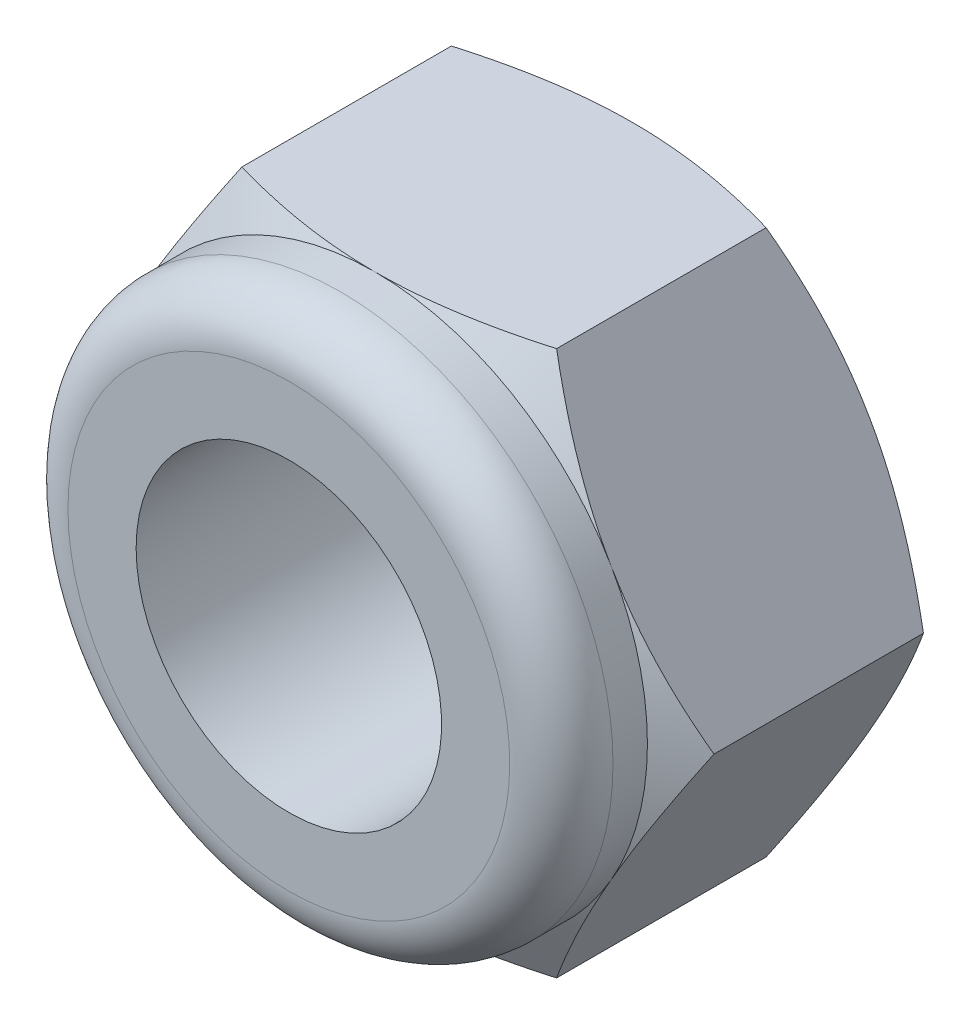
ISO-10303-21;
HEADER;
FILE_DESCRIPTION(('STEP AP214'),'2;1');
FILE_NAME('part.step','',(''),(''),'','','');
FILE_SCHEMA(('AUTOMOTIVE_DESIGN { 1 0 10303 214 1 1 1 1 }'));
ENDSEC;
DATA;
#1=APPLICATION_CONTEXT('core data for automotive mechanical design processes');
#2=APPLICATION_PROTOCOL_DEFINITION('international standard','automotive_design',2000,#1);
#3=PRODUCT_CONTEXT('',#1,'mechanical');
#4=PRODUCT('Part','Part','',(#3));
#5=PRODUCT_RELATED_PRODUCT_CATEGORY('part','',(#4));
#6=PRODUCT_DEFINITION_FORMATION('','',#4);
#7=PRODUCT_DEFINITION_CONTEXT('part definition',#1,'design');
#8=PRODUCT_DEFINITION('design','',#6,#7);
#9=PRODUCT_DEFINITION_SHAPE('','',#8);
#10=(LENGTH_UNIT() NAMED_UNIT(*) SI_UNIT(.MILLI.,.METRE.));
#11=(NAMED_UNIT(*) PLANE_ANGLE_UNIT() SI_UNIT($,.RADIAN.));
#12=(NAMED_UNIT(*) SI_UNIT($,.STERADIAN.) SOLID_ANGLE_UNIT());
#13=UNCERTAINTY_MEASURE_WITH_UNIT(LENGTH_MEASURE(1.E-05),#10,'distance_accuracy_value','');
#14=(GEOMETRIC_REPRESENTATION_CONTEXT(3) GLOBAL_UNCERTAINTY_ASSIGNED_CONTEXT((#13)) GLOBAL_UNIT_ASSIGNED_CONTEXT((#10,
#11,#12)) REPRESENTATION_CONTEXT('',''));
#15=CARTESIAN_POINT('',(0.,0.,0.));
#16=DIRECTION('',(0.,0.,1.));
#17=DIRECTION('',(1.,0.,0.));
#18=AXIS2_PLACEMENT_3D('',#15,#16,#17);
#19=CARTESIAN_POINT('',(0.,0.,-0.853596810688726));
#20=DIRECTION('',(0.,0.,-1.));
#21=DIRECTION('',(-1.,0.,0.));
#22=AXIS2_PLACEMENT_3D('',#19,#20,#21);
#23=CONICAL_SURFACE('',#22,10.9784730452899,1.0471975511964);
#24=CARTESIAN_POINT('',(0.,9.5,-5.96355830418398E-13));
#25=CARTESIAN_POINT('',(0.232800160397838,9.5,3.88261454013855E-05));
#26=CARTESIAN_POINT('',(0.465589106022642,9.5,-0.0049396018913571));
#27=CARTESIAN_POINT('',(0.930709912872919,9.5,-0.0246423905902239));
#28=CARTESIAN_POINT('',(1.16304185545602,9.5,-0.0393648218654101));
#29=CARTESIAN_POINT('',(1.62574797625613,9.5,-0.0781700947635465));
#30=CARTESIAN_POINT('',(1.85612613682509,9.5,-0.102205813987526));
#31=CARTESIAN_POINT('',(2.31578485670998,9.5,-0.159120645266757));
#32=CARTESIAN_POINT('',(2.54506538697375,9.5,-0.191999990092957));
#33=CARTESIAN_POINT('',(3.23031014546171,9.5,-0.302887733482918));
#34=CARTESIAN_POINT('',(3.6842837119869,9.5,-0.393199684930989));
#35=CARTESIAN_POINT('',(4.58832687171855,9.5,-0.601482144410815));
#36=CARTESIAN_POINT('',(5.03836493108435,9.5,-0.719590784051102));
#37=CARTESIAN_POINT('',(5.48482755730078,9.5,-0.848505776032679));
#38=B_SPLINE_CURVE_WITH_KNOTS('',3,(#24,#25,#26,#27,#28,#29,#30,#31,#32,#33,#34,#35,#36,#37),
.UNSPECIFIED.,.F.,.F.,(4,2,2,2,2,2,4),(0.,0.698329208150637,1.39652018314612,2.09122370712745,
2.78594551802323,4.17356828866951,5.56823793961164),.UNSPECIFIED.);
#39=CARTESIAN_POINT('',(0.,9.5,4.54931231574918E-13));
#40=VERTEX_POINT('',#39);
#41=CARTESIAN_POINT('',(5.48482755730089,9.5,-0.848505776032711));
#42=VERTEX_POINT('',#41);
#43=EDGE_CURVE('E340',#40,#42,#38,.T.);
#44=ORIENTED_EDGE('',*,*,#43,.F.);
#45=CARTESIAN_POINT('',(0.,0.,0.));
#46=DIRECTION('',(0.,0.,1.));
#47=DIRECTION('',(1.,0.,0.));
#48=AXIS2_PLACEMENT_3D('',#45,#46,#47);
#49=CIRCLE('',#48,9.5);
#50=CARTESIAN_POINT('',(8.22724133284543,4.75000000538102,0.));
#51=VERTEX_POINT('',#50);
#52=EDGE_CURVE('E518',#51,#40,#49,.T.);
#53=ORIENTED_EDGE('',*,*,#52,.F.);
#54=CARTESIAN_POINT('',(5.48482755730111,9.4999999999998,-0.848505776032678));
#55=CARTESIAN_POINT('',(5.70805886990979,9.11335202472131,-0.719590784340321));
#56=CARTESIAN_POINT('',(5.93307789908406,8.72360763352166,-0.601482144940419));
#57=CARTESIAN_POINT('',(6.3850994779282,7.94068329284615,-0.393199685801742));
#58=CARTESIAN_POINT('',(6.61208626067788,7.54753065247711,-0.302887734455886));
#59=CARTESIAN_POINT('',(6.95470863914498,6.95409128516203,-0.191999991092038));
#60=CARTESIAN_POINT('',(7.06934890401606,6.75552852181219,-0.159120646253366));
#61=CARTESIAN_POINT('',(7.29917826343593,6.35745239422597,-0.102205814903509));
#62=CARTESIAN_POINT('',(7.41436734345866,6.1579390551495,-0.0781700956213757));
#63=CARTESIAN_POINT('',(7.64572040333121,5.75722380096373,-0.0393648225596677));
#64=CARTESIAN_POINT('',(7.761886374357,5.55601843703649,-0.024642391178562));
#65=CARTESIAN_POINT('',(7.9944467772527,5.15321200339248,-0.00493960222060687));
#66=CARTESIAN_POINT('',(8.11084124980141,4.95161086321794,3.88259693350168E-05));
#67=CARTESIAN_POINT('',(8.22724132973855,4.75000001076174,-4.35667272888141E-13));
#68=B_SPLINE_CURVE_WITH_KNOTS('',3,(#54,#55,#56,#57,#58,#59,#60,#61,#62,#63,#64,#65,#66,#67),
.UNSPECIFIED.,.F.,.F.,(4,2,2,2,2,2,4),(0.,1.39466964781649,2.78229241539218,3.47701422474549,
4.1717177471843,4.86990872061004,5.56823792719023),.UNSPECIFIED.);
#69=EDGE_CURVE('E125',#42,#51,#68,.T.);
#70=ORIENTED_EDGE('',*,*,#69,.F.);
#71=EDGE_LOOP('',(#44,#53,#70));
#72=FACE_BOUND('',#71,.T.);
#73=ADVANCED_FACE('F41',(#72),#23,.T.);
#74=CARTESIAN_POINT('',(0.,0.,-0.853596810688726));
#75=DIRECTION('',(0.,0.,-1.));
#76=DIRECTION('',(-1.,0.,0.));
#77=AXIS2_PLACEMENT_3D('',#74,#75,#76);
#78=CONICAL_SURFACE('',#77,10.9784730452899,1.0471975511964);
#79=CARTESIAN_POINT('',(-8.22724132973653,4.75000001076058,9.09388655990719E-13));
#80=CARTESIAN_POINT('',(-8.11084124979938,4.95161086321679,3.88259706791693E-05));
#81=CARTESIAN_POINT('',(-7.99444677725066,5.15321200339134,-0.0049396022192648));
#82=CARTESIAN_POINT('',(-7.76188637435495,5.55601843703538,-0.0246423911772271));
#83=CARTESIAN_POINT('',(-7.64572040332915,5.75722380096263,-0.0393648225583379));
#84=CARTESIAN_POINT('',(-7.41436734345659,6.15793905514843,-0.0781700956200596));
#85=CARTESIAN_POINT('',(-7.29917826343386,6.35745239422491,-0.102205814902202));
#86=CARTESIAN_POINT('',(-7.06934890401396,6.75552852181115,-0.159120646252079));
#87=CARTESIAN_POINT('',(-6.95470863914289,6.954091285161,-0.191999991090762));
#88=CARTESIAN_POINT('',(-6.61208626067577,7.54753065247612,-0.302887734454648));
#89=CARTESIAN_POINT('',(-6.38509947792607,7.94068329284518,-0.393199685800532));
#90=CARTESIAN_POINT('',(-5.93307789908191,8.72360763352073,-0.601482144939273));
#91=CARTESIAN_POINT('',(-5.70805886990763,9.11335202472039,-0.719590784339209));
#92=CARTESIAN_POINT('',(-5.48482755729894,9.49999999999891,-0.848505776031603));
#93=B_SPLINE_CURVE_WITH_KNOTS('',3,(#79,#80,#81,#82,#83,#84,#85,#86,#87,#88,#89,#90,#91,#92),
.UNSPECIFIED.,.F.,.F.,(4,2,2,2,2,2,4),(0.,0.69832920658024,1.39652018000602,2.09122370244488,
2.78594551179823,4.17356827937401,5.56823792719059),.UNSPECIFIED.);
#94=CARTESIAN_POINT('',(-8.22724133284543,4.75000000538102,4.54931231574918E-13));
#95=VERTEX_POINT('',#94);
#96=CARTESIAN_POINT('',(-5.48482755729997,9.49999999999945,-0.848505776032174));
#97=VERTEX_POINT('',#96);
#98=EDGE_CURVE('E173',#95,#97,#93,.T.);
#99=ORIENTED_EDGE('',*,*,#98,.F.);
#100=CARTESIAN_POINT('',(0.,0.,0.));
#101=DIRECTION('',(0.,0.,1.));
#102=DIRECTION('',(1.,0.,0.));
#103=AXIS2_PLACEMENT_3D('',#100,#101,#102);
#104=CIRCLE('',#103,9.5);
#105=EDGE_CURVE('E467',#40,#95,#104,.T.);
#106=ORIENTED_EDGE('',*,*,#105,.F.);
#107=CARTESIAN_POINT('',(-5.48482755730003,9.5,-0.848505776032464));
#108=CARTESIAN_POINT('',(-5.03836493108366,9.5,-0.719590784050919));
#109=CARTESIAN_POINT('',(-4.58832687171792,9.5,-0.601482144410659));
#110=CARTESIAN_POINT('',(-3.68428371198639,9.5,-0.393199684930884));
#111=CARTESIAN_POINT('',(-3.23031014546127,9.5,-0.302887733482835));
#112=CARTESIAN_POINT('',(-2.5450653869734,9.5,-0.191999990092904));
#113=CARTESIAN_POINT('',(-2.31578485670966,9.5,-0.159120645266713));
#114=CARTESIAN_POINT('',(-1.85612613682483,9.5,-0.102205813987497));
#115=CARTESIAN_POINT('',(-1.6257479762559,9.5,-0.0781700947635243));
#116=CARTESIAN_POINT('',(-1.16304185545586,9.5,-0.0393648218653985));
#117=CARTESIAN_POINT('',(-0.930709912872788,9.5,-0.0246423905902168));
#118=CARTESIAN_POINT('',(-0.465589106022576,9.5,-0.00493960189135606));
#119=CARTESIAN_POINT('',(-0.232800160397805,9.5,3.88261454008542E-05));
#120=CARTESIAN_POINT('',(0.,9.5,-5.9638344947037E-13));
#121=B_SPLINE_CURVE_WITH_KNOTS('',3,(#107,#108,#109,#110,#111,#112,#113,#114,#115,#116,#117,
#118,#119,#120),.UNSPECIFIED.,.F.,.F.,(4,2,2,2,2,2,4),(0.,1.39466965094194,2.78229242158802,
3.4770142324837,4.17171775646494,4.86990873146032,5.56823793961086),.UNSPECIFIED.);
#122=EDGE_CURVE('E346',#97,#40,#121,.T.);
#123=ORIENTED_EDGE('',*,*,#122,.F.);
#124=EDGE_LOOP('',(#99,#106,#123));
#125=FACE_BOUND('',#124,.T.);
#126=ADVANCED_FACE('F287',(#125),#78,.T.);
#127=CARTESIAN_POINT('',(0.,0.,-0.853596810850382));
#128=DIRECTION('',(0.,0.,-1.));
#129=DIRECTION('',(0.,1.,0.));
#130=AXIS2_PLACEMENT_3D('',#127,#128,#129);
#131=CONICAL_SURFACE('',#130,10.9784730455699,1.0471975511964);
#132=CARTESIAN_POINT('',(0.,-9.5,-5.96285983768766E-13));
#133=CARTESIAN_POINT('',(-0.232800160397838,-9.5,3.88261454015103E-05));
#134=CARTESIAN_POINT('',(-0.465589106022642,-9.5,-0.00493960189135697));
#135=CARTESIAN_POINT('',(-0.930709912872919,-9.5,-0.0246423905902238));
#136=CARTESIAN_POINT('',(-1.16304185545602,-9.5,-0.0393648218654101));
#137=CARTESIAN_POINT('',(-1.62574797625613,-9.5,-0.0781700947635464));
#138=CARTESIAN_POINT('',(-1.85612613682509,-9.5,-0.102205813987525));
#139=CARTESIAN_POINT('',(-2.31578485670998,-9.5,-0.159120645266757));
#140=CARTESIAN_POINT('',(-2.54506538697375,-9.5,-0.191999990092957));
#141=CARTESIAN_POINT('',(-3.23031014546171,-9.5,-0.302887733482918));
#142=CARTESIAN_POINT('',(-3.6842837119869,-9.5,-0.393199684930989));
#143=CARTESIAN_POINT('',(-4.58832687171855,-9.5,-0.601482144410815));
#144=CARTESIAN_POINT('',(-5.03836493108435,-9.5,-0.719590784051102));
#145=CARTESIAN_POINT('',(-5.48482755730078,-9.5,-0.848505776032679));
#146=B_SPLINE_CURVE_WITH_KNOTS('',3,(#132,#133,#134,#135,#136,#137,#138,#139,#140,#141,#142,
#143,#144,#145),.UNSPECIFIED.,.F.,.F.,(4,2,2,2,2,2,4),(0.,0.698329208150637,1.39652018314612,
2.09122370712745,2.78594551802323,4.17356828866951,5.56823793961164),.UNSPECIFIED.);
#147=CARTESIAN_POINT('',(0.,-9.5,4.54931231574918E-13));
#148=VERTEX_POINT('',#147);
#149=CARTESIAN_POINT('',(-5.48482755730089,-9.5,-0.848505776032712));
#150=VERTEX_POINT('',#149);
#151=EDGE_CURVE('E137',#148,#150,#146,.T.);
#152=ORIENTED_EDGE('',*,*,#151,.F.);
#153=CARTESIAN_POINT('',(0.,0.,0.));
#154=DIRECTION('',(0.,0.,1.));
#155=DIRECTION('',(1.,0.,0.));
#156=AXIS2_PLACEMENT_3D('',#153,#154,#155);
#157=CIRCLE('',#156,9.5);
#158=CARTESIAN_POINT('',(-8.22724144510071,-4.74999981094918,4.54931231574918E-13));
#159=VERTEX_POINT('',#158);
#160=EDGE_CURVE('E509',#159,#148,#157,.T.);
#161=ORIENTED_EDGE('',*,*,#160,.F.);
#162=CARTESIAN_POINT('',(-5.48482755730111,-9.4999999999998,-0.848505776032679));
#163=CARTESIAN_POINT('',(-5.70805888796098,-9.11335199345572,-0.719590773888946));
#164=CARTESIAN_POINT('',(-5.93307793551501,-8.7236075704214,-0.60148212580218));
#165=CARTESIAN_POINT('',(-6.3850995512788,-7.94068316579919,-0.39319965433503));
#166=CARTESIAN_POINT('',(-6.61208635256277,-7.54753049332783,-0.302887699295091));
#167=CARTESIAN_POINT('',(-6.95470875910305,-6.95409107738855,-0.191999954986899));
#168=CARTESIAN_POINT('',(-7.06934903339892,-6.75552829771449,-0.15912061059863));
#169=CARTESIAN_POINT('',(-7.29917841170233,-6.35745213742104,-0.102205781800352));
#170=CARTESIAN_POINT('',(-7.4143675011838,-6.15793878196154,-0.0781700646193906));
#171=CARTESIAN_POINT('',(-7.64572058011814,-5.75722349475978,-0.0393647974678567));
#172=CARTESIAN_POINT('',(-7.76188656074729,-5.55601811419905,-0.0246423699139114));
#173=CARTESIAN_POINT('',(-7.99444698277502,-5.15321164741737,-0.0049395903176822));
#174=CARTESIAN_POINT('',(-8.11084146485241,-4.95161049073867,3.88323371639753E-05));
#175=CARTESIAN_POINT('',(-8.2272415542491,-4.74999962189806,-4.41378657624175E-13));
#176=B_SPLINE_CURVE_WITH_KNOTS('',3,(#162,#163,#164,#165,#166,#167,#168,#169,#170,#171,#172,
#173,#174,#175),.UNSPECIFIED.,.F.,.F.,(4,2,2,2,2,2,4),(0.,1.39466976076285,2.78229263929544,
3.47701450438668,4.17171808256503,4.86990911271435,5.56823837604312),.UNSPECIFIED.);
#177=EDGE_CURVE('E179',#150,#159,#176,.T.);
#178=ORIENTED_EDGE('',*,*,#177,.F.);
#179=EDGE_LOOP('',(#152,#161,#178));
#180=FACE_BOUND('',#179,.T.);
#181=ADVANCED_FACE('F283',(#180),#131,.T.);
#182=CARTESIAN_POINT('',(0.,0.,-0.853596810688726));
#183=DIRECTION('',(0.,0.,-1.));
#184=DIRECTION('',(0.,1.,0.));
#185=AXIS2_PLACEMENT_3D('',#182,#183,#184);
#186=CONICAL_SURFACE('',#185,10.9784730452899,1.0471975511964);
#187=CARTESIAN_POINT('',(8.22724123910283,-4.75000016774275,9.08695617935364E-13));
#188=CARTESIAN_POINT('',(8.11084116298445,-4.95161101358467,3.88234000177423E-05));
#189=CARTESIAN_POINT('',(7.99444669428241,-5.15321214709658,-0.00493960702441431));
#190=CARTESIAN_POINT('',(7.7618862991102,-5.55601856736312,-0.0246423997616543));
#191=CARTESIAN_POINT('',(7.64572033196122,-5.75722392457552,-0.0393648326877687));
#192=CARTESIAN_POINT('',(7.4143672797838,-6.15793916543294,-0.0781701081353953));
#193=CARTESIAN_POINT('',(7.29917820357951,-6.35745249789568,-0.102205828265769));
#194=CARTESIAN_POINT('',(7.0693488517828,-6.75552861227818,-0.159120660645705));
#195=CARTESIAN_POINT('',(6.95470859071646,-6.95409136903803,-0.192000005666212));
#196=CARTESIAN_POINT('',(6.61208622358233,-7.54753071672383,-0.302887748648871));
#197=CARTESIAN_POINT('',(6.38509944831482,-7.94068334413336,-0.393199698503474));
#198=CARTESIAN_POINT('',(5.93307788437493,-8.72360765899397,-0.601482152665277));
#199=CARTESIAN_POINT('',(5.70805886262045,-9.11335203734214,-0.719590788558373));
#200=CARTESIAN_POINT('',(5.48482755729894,-9.49999999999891,-0.848505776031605));
#201=B_SPLINE_CURVE_WITH_KNOTS('',3,(#187,#188,#189,#190,#191,#192,#193,#194,#195,#196,#197,
#198,#199,#200),.UNSPECIFIED.,.F.,.F.,(4,2,2,2,2,2,4),(0.,0.698329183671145,1.39652013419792,
2.09122363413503,2.78594542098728,4.17356814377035,5.5682377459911),.UNSPECIFIED.);
#202=CARTESIAN_POINT('',(8.22724128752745,-4.75000008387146,0.));
#203=VERTEX_POINT('',#202);
#204=CARTESIAN_POINT('',(5.4848275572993,-9.49999999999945,-0.84850577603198));
#205=VERTEX_POINT('',#204);
#206=EDGE_CURVE('E110',#203,#205,#201,.T.);
#207=ORIENTED_EDGE('',*,*,#206,.F.);
#208=CARTESIAN_POINT('',(0.,0.,0.));
#209=DIRECTION('',(0.,0.,1.));
#210=DIRECTION('',(1.,0.,0.));
#211=AXIS2_PLACEMENT_3D('',#208,#209,#210);
#212=CIRCLE('',#211,9.5);
#213=EDGE_CURVE('E131',#148,#203,#212,.T.);
#214=ORIENTED_EDGE('',*,*,#213,.F.);
#215=CARTESIAN_POINT('',(5.48482755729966,-9.5,-0.848505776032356));
#216=CARTESIAN_POINT('',(5.03836493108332,-9.5,-0.719590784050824));
#217=CARTESIAN_POINT('',(4.58832687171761,-9.5,-0.601482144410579));
#218=CARTESIAN_POINT('',(3.68428371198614,-9.5,-0.393199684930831));
#219=CARTESIAN_POINT('',(3.23031014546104,-9.5,-0.302887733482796));
#220=CARTESIAN_POINT('',(2.54506538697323,-9.5,-0.191999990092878));
#221=CARTESIAN_POINT('',(2.3157848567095,-9.5,-0.159120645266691));
#222=CARTESIAN_POINT('',(1.8561261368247,-9.5,-0.102205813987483));
#223=CARTESIAN_POINT('',(1.62574797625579,-9.5,-0.0781700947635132));
#224=CARTESIAN_POINT('',(1.16304185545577,-9.5,-0.039364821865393));
#225=CARTESIAN_POINT('',(0.930709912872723,-9.5,-0.0246423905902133));
#226=CARTESIAN_POINT('',(0.465589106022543,-9.5,-0.00493960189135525));
#227=CARTESIAN_POINT('',(0.232800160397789,-9.5,3.88261454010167E-05));
#228=CARTESIAN_POINT('',(0.,-9.5,-5.9615771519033E-13));
#229=B_SPLINE_CURVE_WITH_KNOTS('',3,(#215,#216,#217,#218,#219,#220,#221,#222,#223,#224,#225,
#226,#227,#228),.UNSPECIFIED.,.F.,.F.,(4,2,2,2,2,2,4),(0.,1.39466965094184,2.78229242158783,
3.47701423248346,4.17171775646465,4.86990873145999,5.56823793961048),.UNSPECIFIED.);
#230=EDGE_CURVE('E128',#205,#148,#229,.T.);
#231=ORIENTED_EDGE('',*,*,#230,.F.);
#232=EDGE_LOOP('',(#207,#214,#231));
#233=FACE_BOUND('',#232,.T.);
#234=ADVANCED_FACE('F129',(#233),#186,.T.);
#235=CARTESIAN_POINT('',(0.,0.,-0.853596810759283));
#236=DIRECTION('',(0.,0.,-1.));
#237=DIRECTION('',(-1.,0.,0.));
#238=AXIS2_PLACEMENT_3D('',#235,#236,#237);
#239=CONICAL_SURFACE('',#238,10.9784730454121,1.0471975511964);
#240=CARTESIAN_POINT('',(8.22724132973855,4.75000001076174,-4.35640868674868E-13));
#241=CARTESIAN_POINT('',(8.34364141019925,4.54838915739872,3.88263217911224E-05));
#242=CARTESIAN_POINT('',(8.46003588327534,4.34678801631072,-0.00493960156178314));
#243=CARTESIAN_POINT('',(8.69259628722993,3.94398158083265,-0.024642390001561));
#244=CARTESIAN_POINT('',(8.80876225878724,3.74277621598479,-0.0393648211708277));
#245=CARTESIAN_POINT('',(9.04011531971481,3.34206095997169,-0.0781700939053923));
#246=CARTESIAN_POINT('',(9.15530440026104,3.14254761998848,-0.102205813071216));
#247=CARTESIAN_POINT('',(9.38513376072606,2.74447149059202,-0.15912064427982));
#248=CARTESIAN_POINT('',(9.49977402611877,2.54590872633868,-0.191999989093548));
#249=CARTESIAN_POINT('',(9.84239640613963,1.9524693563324,-0.302887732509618));
#250=CARTESIAN_POINT('',(10.0693831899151,1.55931671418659,-0.393199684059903));
#251=CARTESIAN_POINT('',(10.5214047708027,0.776392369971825,-0.601482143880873));
#252=CARTESIAN_POINT('',(10.7464238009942,0.386647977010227,-0.719590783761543));
#253=CARTESIAN_POINT('',(10.969655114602,1.27364392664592E-12,-0.848505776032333));
#254=B_SPLINE_CURVE_WITH_KNOTS('',3,(#240,#241,#242,#243,#244,#245,#246,#247,#248,#249,#250,
#251,#252,#253),.UNSPECIFIED.,.F.,.F.,(4,2,2,2,2,2,4),(0.,0.698329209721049,1.39652018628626,
2.09122371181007,2.7859455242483,4.1735682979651,5.56823795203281),.UNSPECIFIED.);
#255=CARTESIAN_POINT('',(10.969655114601,6.3641121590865E-13,-0.848505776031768));
#256=VERTEX_POINT('',#255);
#257=EDGE_CURVE('E157',#51,#256,#254,.T.);
#258=ORIENTED_EDGE('',*,*,#257,.F.);
#259=CARTESIAN_POINT('',(0.,0.,0.));
#260=DIRECTION('',(0.,0.,1.));
#261=DIRECTION('',(1.,0.,0.));
#262=AXIS2_PLACEMENT_3D('',#259,#260,#261);
#263=CIRCLE('',#262,9.5);
#264=EDGE_CURVE('E502',#203,#51,#263,.T.);
#265=ORIENTED_EDGE('',*,*,#264,.F.);
#266=CARTESIAN_POINT('',(10.9696551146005,8.06290436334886E-13,-0.848505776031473));
#267=CARTESIAN_POINT('',(10.7464237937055,-0.386647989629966,-0.719590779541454));
#268=CARTESIAN_POINT('',(10.5214047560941,-0.77639239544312,-0.601482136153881));
#269=CARTESIAN_POINT('',(10.0693831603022,-1.55931676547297,-0.393199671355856));
#270=CARTESIAN_POINT('',(9.84239636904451,-1.95246942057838,-0.302887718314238));
#271=CARTESIAN_POINT('',(9.49977397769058,-2.5459088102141,-0.191999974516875));
#272=CARTESIAN_POINT('',(9.38513370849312,-2.74447158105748,-0.159120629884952));
#273=CARTESIAN_POINT('',(9.15530434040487,-3.14254772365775,-0.102205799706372));
#274=CARTESIAN_POINT('',(9.04011525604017,-3.34206107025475,-0.0781700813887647));
#275=CARTESIAN_POINT('',(8.80876218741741,-3.74277633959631,-0.0393648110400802));
#276=CARTESIAN_POINT('',(8.69259621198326,-3.94398171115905,-0.0246423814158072));
#277=CARTESIAN_POINT('',(8.46003580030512,-4.34678816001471,-0.00493959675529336));
#278=CARTESIAN_POINT('',(8.34364132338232,-4.54838930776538,3.88288937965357E-05));
#279=CARTESIAN_POINT('',(8.22724123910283,-4.75000016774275,9.09138332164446E-13));
#280=B_SPLINE_CURVE_WITH_KNOTS('',3,(#266,#267,#268,#269,#270,#271,#272,#273,#274,#275,#276,
#277,#278,#279),.UNSPECIFIED.,.F.,.F.,(4,2,2,2,2,2,4),(0.,1.39466969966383,2.78229251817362,
3.47701435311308,4.17171790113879,4.86990890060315,5.56823813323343),.UNSPECIFIED.);
#281=EDGE_CURVE('E119',#256,#203,#280,.T.);
#282=ORIENTED_EDGE('',*,*,#281,.F.);
#283=EDGE_LOOP('',(#258,#265,#282));
#284=FACE_BOUND('',#283,.T.);
#285=ADVANCED_FACE('F597',(#284),#239,.T.);
#286=CARTESIAN_POINT('',(0.,0.,-0.853596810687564));
#287=DIRECTION('',(0.,0.,-1.));
#288=DIRECTION('',(-1.,0.,0.));
#289=AXIS2_PLACEMENT_3D('',#286,#287,#288);
#290=CONICAL_SURFACE('',#289,10.9784730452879,1.0471975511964);
#291=CARTESIAN_POINT('',(-8.2272415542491,-4.74999962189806,-4.40768663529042E-13));
#292=CARTESIAN_POINT('',(-8.34364162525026,-4.54838878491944,3.88199539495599E-05));
#293=CARTESIAN_POINT('',(-8.46003608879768,-4.3467876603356,-0.00493961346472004));
#294=CARTESIAN_POINT('',(-8.69259647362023,-3.94398125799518,-0.0246424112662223));
#295=CARTESIAN_POINT('',(-8.8087624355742,-3.74277590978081,-0.0393648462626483));
#296=CARTESIAN_POINT('',(-9.04011547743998,-3.34206068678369,-0.0781701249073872));
#297=CARTESIAN_POINT('',(-9.15530454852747,-3.14254736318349,-0.102205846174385));
#298=CARTESIAN_POINT('',(-9.38513389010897,-2.74447126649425,-0.15912067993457));
#299=CARTESIAN_POINT('',(-9.49977414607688,-2.54590851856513,-0.192000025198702));
#300=CARTESIAN_POINT('',(-9.84239649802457,-1.95246919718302,-0.302887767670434));
#301=CARTESIAN_POINT('',(-10.0693832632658,-1.55931658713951,-0.39319971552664));
#302=CARTESIAN_POINT('',(-10.5214048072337,-0.776392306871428,-0.60148216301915));
#303=CARTESIAN_POINT('',(-10.7464238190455,-0.386647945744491,-0.719590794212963));
#304=CARTESIAN_POINT('',(-10.969655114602,-1.11308510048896E-12,-0.848505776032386));
#305=B_SPLINE_CURVE_WITH_KNOTS('',3,(#291,#292,#293,#294,#295,#296,#297,#298,#299,#300,#301,
#302,#303,#304),.UNSPECIFIED.,.F.,.F.,(4,2,2,2,2,2,4),(0.,0.698329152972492,1.39652007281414,
2.09122354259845,2.78594529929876,4.1735679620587,5.56823750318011),.UNSPECIFIED.);
#306=CARTESIAN_POINT('',(-10.969655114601,-5.55759200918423E-13,-0.848505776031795));
#307=VERTEX_POINT('',#306);
#308=EDGE_CURVE('E136',#159,#307,#305,.T.);
#309=ORIENTED_EDGE('',*,*,#308,.F.);
#310=CARTESIAN_POINT('',(0.,0.,0.));
#311=DIRECTION('',(0.,0.,1.));
#312=DIRECTION('',(1.,0.,0.));
#313=AXIS2_PLACEMENT_3D('',#310,#311,#312);
#314=CIRCLE('',#313,9.5);
#315=EDGE_CURVE('E180',#95,#159,#314,.T.);
#316=ORIENTED_EDGE('',*,*,#315,.F.);
#317=CARTESIAN_POINT('',(-10.9696551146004,-6.45071824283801E-13,-0.848505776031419));
#318=CARTESIAN_POINT('',(-10.7464238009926,0.386647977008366,-0.71959078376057));
#319=CARTESIAN_POINT('',(-10.521404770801,0.776392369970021,-0.601482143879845));
#320=CARTESIAN_POINT('',(-10.0693831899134,1.5593167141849,-0.393199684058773));
#321=CARTESIAN_POINT('',(-9.84239640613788,1.95246935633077,-0.302887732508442));
#322=CARTESIAN_POINT('',(-9.49977402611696,2.54590872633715,-0.191999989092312));
#323=CARTESIAN_POINT('',(-9.38513376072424,2.74447149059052,-0.159120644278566));
#324=CARTESIAN_POINT('',(-9.15530440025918,3.14254761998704,-0.102205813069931));
#325=CARTESIAN_POINT('',(-9.04011531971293,3.34206095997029,-0.0781700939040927));
#326=CARTESIAN_POINT('',(-8.80876225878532,3.74277621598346,-0.0393648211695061));
#327=CARTESIAN_POINT('',(-8.692596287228,3.94398158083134,-0.0246423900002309));
#328=CARTESIAN_POINT('',(-8.46003588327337,4.34678801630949,-0.00493960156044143));
#329=CARTESIAN_POINT('',(-8.34364141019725,4.54838915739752,3.8826323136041E-05));
#330=CARTESIAN_POINT('',(-8.22724132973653,4.75000001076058,9.09874504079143E-13));
#331=B_SPLINE_CURVE_WITH_KNOTS('',3,(#317,#318,#319,#320,#321,#322,#323,#324,#325,#326,#327,
#328,#329,#330),.UNSPECIFIED.,.F.,.F.,(4,2,2,2,2,2,4),(0.,1.39466965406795,2.78229242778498,
3.47701424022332,4.17171776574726,4.86990874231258,5.56823795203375),.UNSPECIFIED.);
#332=EDGE_CURVE('E172',#307,#95,#331,.T.);
#333=ORIENTED_EDGE('',*,*,#332,.F.);
#334=EDGE_LOOP('',(#309,#316,#333));
#335=FACE_BOUND('',#334,.T.);
#336=ADVANCED_FACE('F260',(#335),#290,.T.);
#337=CARTESIAN_POINT('',(5.484827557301,-9.5,0.));
#338=DIRECTION('',(0.,-1.,0.));
#339=DIRECTION('',(0.,0.,-1.));
#340=AXIS2_PLACEMENT_3D('',#337,#338,#339);
#341=PLANE('',#340);
#342=DIRECTION('',(0.,0.,1.));
#343=VECTOR('',#342,1.);
#344=CARTESIAN_POINT('',(5.48482755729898,-9.49999999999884,0.));
#345=LINE('',#344,#343);
#346=CARTESIAN_POINT('',(5.48482757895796,-9.49999996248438,-8.15149423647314));
#347=VERTEX_POINT('',#346);
#348=EDGE_CURVE('E116',#205,#347,#345,.F.);
#349=ORIENTED_EDGE('',*,*,#348,.F.);
#350=ORIENTED_EDGE('',*,*,#230,.T.);
#351=ORIENTED_EDGE('',*,*,#151,.T.);
#352=DIRECTION('',(0.,0.,1.));
#353=VECTOR('',#352,1.);
#354=CARTESIAN_POINT('',(-5.484827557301,-9.5,0.));
#355=LINE('',#354,#353);
#356=CARTESIAN_POINT('',(-5.48482751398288,-9.5,-8.15149423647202));
#357=VERTEX_POINT('',#356);
#358=EDGE_CURVE('E174',#357,#150,#355,.T.);
#359=ORIENTED_EDGE('',*,*,#358,.F.);
#360=CARTESIAN_POINT('',(0.,-9.5,-8.9999999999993));
#361=CARTESIAN_POINT('',(-0.232800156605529,-9.5,-9.00003882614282));
#362=CARTESIAN_POINT('',(-0.465589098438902,-9.5,-8.99506039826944));
#363=CARTESIAN_POINT('',(-0.930709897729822,-9.5,-8.97535761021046));
#364=CARTESIAN_POINT('',(-1.16304183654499,-9.5,-8.96063517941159));
#365=CARTESIAN_POINT('',(-1.62574794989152,-9.5,-8.92182990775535));
#366=CARTESIAN_POINT('',(-1.85612610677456,-9.5,-8.89779418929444));
#367=CARTESIAN_POINT('',(-2.31578481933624,-9.5,-8.84087935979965));
#368=CARTESIAN_POINT('',(-2.54506534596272,-9.5,-8.80800001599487));
#369=CARTESIAN_POINT('',(-3.2303100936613,-9.5,-8.69711227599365));
#370=CARTESIAN_POINT('',(-3.68428365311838,-9.5,-8.60680032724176));
#371=CARTESIAN_POINT('',(-4.58832679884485,-9.5,-8.39851787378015));
#372=CARTESIAN_POINT('',(-5.03836485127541,-9.5,-8.28040923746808));
#373=CARTESIAN_POINT('',(-5.48482747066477,-9.5,-8.15149424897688));
#374=B_SPLINE_CURVE_WITH_KNOTS('',3,(#360,#361,#362,#363,#364,#365,#366,#367,#368,#369,#370,
#371,#372,#373),.UNSPECIFIED.,.F.,.F.,(4,2,2,2,2,2,4),(0.,0.698329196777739,1.39652016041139,
2.0912236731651,2.78594547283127,4.17356822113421,5.56823784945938),.UNSPECIFIED.);
#375=CARTESIAN_POINT('',(0.,-9.49999999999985,-8.99999999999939));
#376=VERTEX_POINT('',#375);
#377=EDGE_CURVE('E247',#376,#357,#374,.T.);
#378=ORIENTED_EDGE('',*,*,#377,.F.);
#379=CARTESIAN_POINT('',(5.48482758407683,-9.49999996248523,-8.1514941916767));
#380=CARTESIAN_POINT('',(5.0383649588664,-9.49999998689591,-8.2804091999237));
#381=CARTESIAN_POINT('',(4.58832689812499,-9.49999999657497,-8.39851784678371));
#382=CARTESIAN_POINT('',(3.68428373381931,-9.50000000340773,-8.60680031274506));
#383=CARTESIAN_POINT('',(3.23031016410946,-9.50000000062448,-8.6971122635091));
#384=CARTESIAN_POINT('',(2.54506540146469,-9.49999999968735,-8.80800000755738));
#385=CARTESIAN_POINT('',(2.31578487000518,-9.49999999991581,-8.8408793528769));
#386=CARTESIAN_POINT('',(1.85612614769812,-9.50000000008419,-8.89779418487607));
#387=CARTESIAN_POINT('',(1.62574798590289,-9.50000000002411,-8.92182990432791));
#388=CARTESIAN_POINT('',(1.16304186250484,-9.49999999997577,-8.96063517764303));
#389=CARTESIAN_POINT('',(0.930709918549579,-9.49999999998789,-8.97535760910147));
#390=CARTESIAN_POINT('',(0.465589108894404,-9.50000000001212,-8.99506039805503));
#391=CARTESIAN_POINT('',(0.232800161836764,-9.50000000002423,-9.00003882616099));
#392=CARTESIAN_POINT('',(0.,-9.5,-8.9999999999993));
#393=B_SPLINE_CURVE_WITH_KNOTS('',3,(#379,#380,#381,#382,#383,#384,#385,#386,#387,#388,#389,
#390,#391,#392),.UNSPECIFIED.,.F.,.F.,(4,2,2,2,2,2,4),(0.,1.39466966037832,2.7822924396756,
3.47701425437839,4.17171778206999,4.86990876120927,5.56823797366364),.UNSPECIFIED.);
#394=EDGE_CURVE('E142',#347,#376,#393,.T.);
#395=ORIENTED_EDGE('',*,*,#394,.F.);
#396=EDGE_LOOP('',(#349,#350,#351,#359,#378,#395));
#397=FACE_BOUND('',#396,.T.);
#398=ADVANCED_FACE('F140',(#397),#341,.T.);
#399=CARTESIAN_POINT('',(-5.484827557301,-9.5,0.));
#400=DIRECTION('',(-0.866025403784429,-0.500000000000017,0.));
#401=DIRECTION('',(0.500000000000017,-0.866025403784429,0.));
#402=AXIS2_PLACEMENT_3D('',#399,#400,#401);
#403=PLANE('',#402);
#404=ORIENTED_EDGE('',*,*,#358,.T.);
#405=ORIENTED_EDGE('',*,*,#177,.T.);
#406=ORIENTED_EDGE('',*,*,#308,.T.);
#407=DIRECTION('',(0.,0.,1.));
#408=VECTOR('',#407,1.);
#409=CARTESIAN_POINT('',(-10.9696551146,0.,0.));
#410=LINE('',#409,#408);
#411=CARTESIAN_POINT('',(-10.969655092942,-3.7515128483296E-08,-8.15149423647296));
#412=VERTEX_POINT('',#411);
#413=EDGE_CURVE('E167',#412,#307,#410,.T.);
#414=ORIENTED_EDGE('',*,*,#413,.F.);
#415=CARTESIAN_POINT('',(-8.22724154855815,-4.74999963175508,-8.99999999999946));
#416=CARTESIAN_POINT('',(-8.34364161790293,-4.54838879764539,-9.00003882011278));
#417=CARTESIAN_POINT('',(-8.46003607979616,-4.34678767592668,-8.9950603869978));
#418=CARTESIAN_POINT('',(-8.692596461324,-3.94398127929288,-8.97535759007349));
#419=CARTESIAN_POINT('',(-8.80876242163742,-3.74277593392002,-8.96063515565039));
#420=CARTESIAN_POINT('',(-9.04011546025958,-3.342060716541,-8.92182987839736));
#421=CARTESIAN_POINT('',(-9.15530452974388,-3.14254739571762,-8.89779415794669));
#422=CARTESIAN_POINT('',(-9.38513386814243,-2.74447130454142,-8.84087932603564));
#423=CARTESIAN_POINT('',(-9.4997741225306,-2.5459085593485,-8.80799998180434));
#424=CARTESIAN_POINT('',(-9.84239646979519,-1.95246924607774,-8.69711224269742));
#425=CARTESIAN_POINT('',(-10.0693832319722,-1.55931664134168,-8.60680029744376));
#426=CARTESIAN_POINT('',(-10.5214047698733,-0.776392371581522,-8.39851785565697));
#427=CARTESIAN_POINT('',(-10.7464237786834,-0.38664801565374,-8.28040922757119));
#428=CARTESIAN_POINT('',(-10.969655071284,-7.5030257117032E-08,-8.15149424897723));
#429=B_SPLINE_CURVE_WITH_KNOTS('',3,(#415,#416,#417,#418,#419,#420,#421,#422,#423,#424,#425,
#426,#427,#428),.UNSPECIFIED.,.F.,.F.,(4,2,2,2,2,2,4),(0.,0.698329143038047,1.39652005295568,
2.09122351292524,2.78594525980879,4.17356790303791,5.56823742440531),.UNSPECIFIED.);
#430=CARTESIAN_POINT('',(-8.22724144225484,-4.74999981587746,-8.99999999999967));
#431=VERTEX_POINT('',#430);
#432=EDGE_CURVE('E409',#431,#412,#429,.T.);
#433=ORIENTED_EDGE('',*,*,#432,.F.);
#434=CARTESIAN_POINT('',(-5.4848275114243,-9.5000000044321,-8.15149419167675));
#435=CARTESIAN_POINT('',(-5.70805886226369,-9.11335201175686,-8.28040920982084));
#436=CARTESIAN_POINT('',(-5.93307791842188,-8.72360759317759,-8.39851786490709));
#437=CARTESIAN_POINT('',(-6.38509954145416,-7.94068318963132,-8.60680034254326));
#438=CARTESIAN_POINT('',(-6.61208634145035,-7.54753051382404,-8.69711229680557));
#439=CARTESIAN_POINT('',(-6.95470874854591,-6.95409109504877,-8.80800004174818));
#440=CARTESIAN_POINT('',(-7.06934902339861,-6.75552831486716,-8.84087938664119));
#441=CARTESIAN_POINT('',(-7.29917840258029,-6.35745215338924,-8.89779421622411));
#442=CARTESIAN_POINT('',(-7.41436749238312,-6.15793879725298,-8.9218299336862));
#443=CARTESIAN_POINT('',(-7.64572057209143,-5.75722350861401,-8.96063520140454));
#444=CARTESIAN_POINT('',(-7.76188655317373,-5.55601812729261,-8.97535762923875));
#445=CARTESIAN_POINT('',(-7.99444697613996,-5.15321165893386,-8.99506040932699));
#446=CARTESIAN_POINT('',(-8.11084145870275,-4.95161050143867,-9.00003883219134));
#447=CARTESIAN_POINT('',(-8.22724154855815,-4.74999963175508,-8.99999999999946));
#448=B_SPLINE_CURVE_WITH_KNOTS('',3,(#434,#435,#436,#437,#438,#439,#440,#441,#442,#443,#444,
#445,#446,#447),.UNSPECIFIED.,.F.,.F.,(4,2,2,2,2,2,4),(0.,1.39466976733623,2.78229265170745,
3.47701451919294,4.17171809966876,4.86990913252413,5.56823839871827),.UNSPECIFIED.);
#449=EDGE_CURVE('E415',#357,#431,#448,.T.);
#450=ORIENTED_EDGE('',*,*,#449,.F.);
#451=EDGE_LOOP('',(#404,#405,#406,#414,#433,#450));
#452=FACE_BOUND('',#451,.T.);
#453=ADVANCED_FACE('F259',(#452),#403,.T.);
#454=CARTESIAN_POINT('',(-10.9696551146,0.,0.));
#455=DIRECTION('',(-0.866025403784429,0.500000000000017,0.));
#456=DIRECTION('',(-0.500000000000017,-0.866025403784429,0.));
#457=AXIS2_PLACEMENT_3D('',#454,#455,#456);
#458=PLANE('',#457);
#459=ORIENTED_EDGE('',*,*,#413,.T.);
#460=ORIENTED_EDGE('',*,*,#332,.T.);
#461=ORIENTED_EDGE('',*,*,#98,.T.);
#462=DIRECTION('',(0.,0.,1.));
#463=VECTOR('',#462,1.);
#464=CARTESIAN_POINT('',(-5.484827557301,9.5,0.));
#465=LINE('',#464,#463);
#466=CARTESIAN_POINT('',(-5.48482757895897,9.49999996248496,-8.15149423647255));
#467=VERTEX_POINT('',#466);
#468=EDGE_CURVE('E158',#467,#97,#465,.T.);
#469=ORIENTED_EDGE('',*,*,#468,.F.);
#470=CARTESIAN_POINT('',(-8.22724133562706,4.75000000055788,-9.00000000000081));
#471=CARTESIAN_POINT('',(-8.11084125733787,4.95161085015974,-9.00003882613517));
#472=CARTESIAN_POINT('',(-7.99444678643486,5.15321198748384,-8.99506039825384));
#473=CARTESIAN_POINT('',(-7.76188638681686,5.55601841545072,-8.97535761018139));
#474=CARTESIAN_POINT('',(-7.64572041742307,5.75722377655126,-8.96063517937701));
#475=CARTESIAN_POINT('',(-7.41436736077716,6.15793902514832,-8.92182990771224));
#476=CARTESIAN_POINT('',(-7.29917828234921,6.35745236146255,-8.89779418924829));
#477=CARTESIAN_POINT('',(-7.06934892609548,6.75552848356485,-8.84087935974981));
#478=CARTESIAN_POINT('',(-6.95470866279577,6.95409124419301,-8.80800001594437));
#479=CARTESIAN_POINT('',(-6.61208628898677,7.54753060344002,-8.69711227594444));
#480=CARTESIAN_POINT('',(-6.38509950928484,7.94068323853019,-8.60680032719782));
#481=CARTESIAN_POINT('',(-5.93307793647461,8.72360756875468,-8.39851787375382));
#482=CARTESIAN_POINT('',(-5.70805891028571,9.1133519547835,-8.28040923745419));
#483=CARTESIAN_POINT('',(-5.48482760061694,9.49999992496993,-8.15149424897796));
#484=B_SPLINE_CURVE_WITH_KNOTS('',3,(#470,#471,#472,#473,#474,#475,#476,#477,#478,#479,#480,
#481,#482,#483),.UNSPECIFIED.,.F.,.F.,(4,2,2,2,2,2,4),(0.,0.698329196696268,1.39652016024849,
2.09122367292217,2.78594547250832,4.17356822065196,5.56823784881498),.UNSPECIFIED.);
#485=CARTESIAN_POINT('',(-8.22724133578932,4.75000000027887,-8.99999999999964));
#486=VERTEX_POINT('',#485);
#487=EDGE_CURVE('E381',#486,#467,#484,.T.);
#488=ORIENTED_EDGE('',*,*,#487,.F.);
#489=CARTESIAN_POINT('',(-10.9696551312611,-2.88577854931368E-08,-8.15149421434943));
#490=CARTESIAN_POINT('',(-10.746423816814,0.386647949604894,-8.28040920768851));
#491=CARTESIAN_POINT('',(-10.521404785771,0.776392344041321,-8.3985178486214));
#492=CARTESIAN_POINT('',(-10.0693832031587,1.55931669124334,-8.60680031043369));
#493=CARTESIAN_POINT('',(-9.84239641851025,1.95246933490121,-8.69711226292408));
#494=CARTESIAN_POINT('',(-9.49977403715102,2.5459087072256,-8.80800000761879));
#495=CARTESIAN_POINT('',(-9.3851337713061,2.74447147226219,-8.84087935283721));
#496=CARTESIAN_POINT('',(-9.15530440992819,3.14254760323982,-8.89779418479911));
#497=CARTESIAN_POINT('',(-9.04011532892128,3.34206094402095,-8.92182990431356));
#498=CARTESIAN_POINT('',(-8.80876226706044,3.74277620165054,-8.96063517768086));
#499=CARTESIAN_POINT('',(-8.69259629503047,3.94398156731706,-8.97535760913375));
#500=CARTESIAN_POINT('',(-8.4600358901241,4.34678800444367,-8.99506039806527));
#501=CARTESIAN_POINT('',(-8.34364141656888,4.54838914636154,-9.00003882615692));
#502=CARTESIAN_POINT('',(-8.22724133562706,4.75000000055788,-9.00000000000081));
#503=B_SPLINE_CURVE_WITH_KNOTS('',3,(#489,#490,#491,#492,#493,#494,#495,#496,#497,#498,#499,
#500,#501,#502),.UNSPECIFIED.,.F.,.F.,(4,2,2,2,2,2,4),(0.,1.39466965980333,2.78229243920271,
3.47701425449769,4.17171778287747,4.86990876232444,5.56823797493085),.UNSPECIFIED.);
#504=EDGE_CURVE('E403',#412,#486,#503,.T.);
#505=ORIENTED_EDGE('',*,*,#504,.F.);
#506=EDGE_LOOP('',(#459,#460,#461,#469,#488,#505));
#507=FACE_BOUND('',#506,.T.);
#508=ADVANCED_FACE('F360',(#507),#458,.T.);
#509=CARTESIAN_POINT('',(-5.484827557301,9.5,0.));
#510=DIRECTION('',(0.,1.,0.));
#511=DIRECTION('',(0.,0.,1.));
#512=AXIS2_PLACEMENT_3D('',#509,#510,#511);
#513=PLANE('',#512);
#514=ORIENTED_EDGE('',*,*,#468,.T.);
#515=ORIENTED_EDGE('',*,*,#122,.T.);
#516=ORIENTED_EDGE('',*,*,#43,.T.);
#517=DIRECTION('',(0.,0.,1.));
#518=VECTOR('',#517,1.);
#519=CARTESIAN_POINT('',(5.484827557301,9.5,0.));
#520=LINE('',#519,#518);
#521=CARTESIAN_POINT('',(5.48482751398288,9.5,-8.15149423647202));
#522=VERTEX_POINT('',#521);
#523=EDGE_CURVE('E152',#522,#42,#520,.T.);
#524=ORIENTED_EDGE('',*,*,#523,.F.);
#525=CARTESIAN_POINT('',(0.,9.5,-8.9999999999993));
#526=CARTESIAN_POINT('',(0.232800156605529,9.5,-9.00003882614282));
#527=CARTESIAN_POINT('',(0.465589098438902,9.5,-8.99506039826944));
#528=CARTESIAN_POINT('',(0.930709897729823,9.5,-8.97535761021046));
#529=CARTESIAN_POINT('',(1.16304183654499,9.5,-8.96063517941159));
#530=CARTESIAN_POINT('',(1.62574794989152,9.5,-8.92182990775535));
#531=CARTESIAN_POINT('',(1.85612610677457,9.5,-8.89779418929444));
#532=CARTESIAN_POINT('',(2.31578481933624,9.5,-8.84087935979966));
#533=CARTESIAN_POINT('',(2.54506534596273,9.5,-8.80800001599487));
#534=CARTESIAN_POINT('',(3.23031009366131,9.5,-8.69711227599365));
#535=CARTESIAN_POINT('',(3.68428365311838,9.5,-8.60680032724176));
#536=CARTESIAN_POINT('',(4.58832679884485,9.5,-8.39851787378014));
#537=CARTESIAN_POINT('',(5.03836485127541,9.5,-8.28040923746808));
#538=CARTESIAN_POINT('',(5.48482747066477,9.5,-8.15149424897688));
#539=B_SPLINE_CURVE_WITH_KNOTS('',3,(#525,#526,#527,#528,#529,#530,#531,#532,#533,#534,#535,
#536,#537,#538),.UNSPECIFIED.,.F.,.F.,(4,2,2,2,2,2,4),(0.,0.698329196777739,1.39652016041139,
2.0912236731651,2.78594547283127,4.17356822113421,5.56823784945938),.UNSPECIFIED.);
#540=CARTESIAN_POINT('',(0.,9.49999999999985,-8.99999999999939));
#541=VERTEX_POINT('',#540);
#542=EDGE_CURVE('E367',#541,#522,#539,.T.);
#543=ORIENTED_EDGE('',*,*,#542,.F.);
#544=CARTESIAN_POINT('',(-5.48482758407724,9.49999996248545,-8.15149419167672));
#545=CARTESIAN_POINT('',(-5.03836495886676,9.49999998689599,-8.28040919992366));
#546=CARTESIAN_POINT('',(-4.58832689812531,9.49999999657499,-8.39851784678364));
#547=CARTESIAN_POINT('',(-3.68428373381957,9.50000000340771,-8.60680031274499));
#548=CARTESIAN_POINT('',(-3.23031016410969,9.50000000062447,-8.69711226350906));
#549=CARTESIAN_POINT('',(-2.54506540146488,9.49999999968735,-8.80800000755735));
#550=CARTESIAN_POINT('',(-2.31578487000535,9.49999999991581,-8.84087935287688));
#551=CARTESIAN_POINT('',(-1.85612614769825,9.50000000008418,-8.89779418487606));
#552=CARTESIAN_POINT('',(-1.62574798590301,9.5000000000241,-8.9218299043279));
#553=CARTESIAN_POINT('',(-1.16304186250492,9.49999999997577,-8.96063517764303));
#554=CARTESIAN_POINT('',(-0.930709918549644,9.49999999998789,-8.97535760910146));
#555=CARTESIAN_POINT('',(-0.465589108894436,9.50000000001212,-8.99506039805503));
#556=CARTESIAN_POINT('',(-0.232800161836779,9.50000000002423,-9.00003882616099));
#557=CARTESIAN_POINT('',(0.,9.5,-8.9999999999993));
#558=B_SPLINE_CURVE_WITH_KNOTS('',3,(#544,#545,#546,#547,#548,#549,#550,#551,#552,#553,#554,
#555,#556,#557),.UNSPECIFIED.,.F.,.F.,(4,2,2,2,2,2,4),(0.,1.39466966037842,2.78229243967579,
3.47701425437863,4.17171778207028,4.86990876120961,5.56823797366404),.UNSPECIFIED.);
#559=EDGE_CURVE('E373',#467,#541,#558,.T.);
#560=ORIENTED_EDGE('',*,*,#559,.F.);
#561=EDGE_LOOP('',(#514,#515,#516,#524,#543,#560));
#562=FACE_BOUND('',#561,.T.);
#563=ADVANCED_FACE('F357',(#562),#513,.T.);
#564=CARTESIAN_POINT('',(5.484827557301,9.5,0.));
#565=DIRECTION('',(0.866025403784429,0.500000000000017,0.));
#566=DIRECTION('',(-0.500000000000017,0.866025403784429,0.));
#567=AXIS2_PLACEMENT_3D('',#564,#565,#566);
#568=PLANE('',#567);
#569=ORIENTED_EDGE('',*,*,#523,.T.);
#570=ORIENTED_EDGE('',*,*,#69,.T.);
#571=ORIENTED_EDGE('',*,*,#257,.T.);
#572=DIRECTION('',(0.,0.,1.));
#573=VECTOR('',#572,1.);
#574=CARTESIAN_POINT('',(10.9696551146,0.,0.));
#575=LINE('',#574,#573);
#576=CARTESIAN_POINT('',(10.9696551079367,1.15435565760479E-08,-8.15149422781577));
#577=VERTEX_POINT('',#576);
#578=EDGE_CURVE('E144',#577,#256,#575,.T.);
#579=ORIENTED_EDGE('',*,*,#578,.F.);
#580=CARTESIAN_POINT('',(8.22724133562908,4.75000000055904,-8.99999999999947));
#581=CARTESIAN_POINT('',(8.34364141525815,4.54838914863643,-9.00003882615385));
#582=CARTESIAN_POINT('',(8.46003588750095,4.34678800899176,-8.99506039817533));
#583=CARTESIAN_POINT('',(8.69259628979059,3.94398157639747,-8.97535760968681));
#584=CARTESIAN_POINT('',(8.80876226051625,3.74277621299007,-8.96063517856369));
#585=CARTESIAN_POINT('',(9.04011531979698,3.34206095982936,-8.92182990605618));
#586=CARTESIAN_POINT('',(9.15530439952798,3.14254762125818,-8.89779418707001));
#587=CARTESIAN_POINT('',(9.38513375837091,2.74447149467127,-8.84087935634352));
#588=CARTESIAN_POINT('',(9.49977402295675,2.54590873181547,-8.80800001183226));
#589=CARTESIAN_POINT('',(9.84239640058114,1.95246936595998,-8.69711226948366));
#590=CARTESIAN_POINT('',(10.069383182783,1.55931672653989,-8.60680031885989));
#591=CARTESIAN_POINT('',(10.5214047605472,0.776392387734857,-8.39851786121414));
#592=CARTESIAN_POINT('',(10.7464237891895,0.386647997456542,-8.28040922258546));
#593=CARTESIAN_POINT('',(10.9696551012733,2.30871129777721E-08,-8.15149423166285));
#594=B_SPLINE_CURVE_WITH_KNOTS('',3,(#580,#581,#582,#583,#584,#585,#586,#587,#588,#589,#590,
#591,#592,#593),.UNSPECIFIED.,.F.,.F.,(4,2,2,2,2,2,4),(0.,0.69832920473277,1.39652017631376,
2.09122369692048,2.78594550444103,4.17356826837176,5.56823791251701),.UNSPECIFIED.);
#595=CARTESIAN_POINT('',(8.22724133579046,4.75000000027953,-8.99999999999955));
#596=VERTEX_POINT('',#595);
#597=EDGE_CURVE('E203',#596,#577,#594,.T.);
#598=ORIENTED_EDGE('',*,*,#597,.F.);
#599=CARTESIAN_POINT('',(5.4848275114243,9.5000000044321,-8.15149419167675));
#600=CARTESIAN_POINT('',(5.70805884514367,9.1133520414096,-8.28040919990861));
#601=CARTESIAN_POINT('',(5.93307788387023,8.7236076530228,-8.39851784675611));
#602=CARTESIAN_POINT('',(6.38509947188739,7.94068331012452,-8.60680031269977));
#603=CARTESIAN_POINT('',(6.61208625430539,7.54753066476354,-8.69711226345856));
#604=CARTESIAN_POINT('',(6.95470863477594,6.95409129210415,-8.80800000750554));
#605=CARTESIAN_POINT('',(7.06934890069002,6.75552852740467,-8.84087935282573));
#606=CARTESIAN_POINT('',(7.29917826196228,6.35745239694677,-8.89779418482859));
#607=CARTESIAN_POINT('',(7.4143673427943,6.15793905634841,-8.92182990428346));
#608=CARTESIAN_POINT('',(7.64572040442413,5.75722379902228,-8.9606351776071));
#609=CARTESIAN_POINT('',(7.76188637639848,5.55601843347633,-8.97535760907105));
#610=CARTESIAN_POINT('',(7.99444678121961,5.15321199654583,-8.99506039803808));
#611=CARTESIAN_POINT('',(8.11084125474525,4.95161085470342,-9.000038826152));
#612=CARTESIAN_POINT('',(8.22724133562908,4.75000000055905,-8.99999999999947));
#613=B_SPLINE_CURVE_WITH_KNOTS('',3,(#599,#600,#601,#602,#603,#604,#605,#606,#607,#608,#609,
#610,#611,#612),.UNSPECIFIED.,.F.,.F.,(4,2,2,2,2,2,4),(0.,1.39466966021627,2.78229243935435,
3.47701425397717,4.17171778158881,4.86990876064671,5.56823797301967),.UNSPECIFIED.);
#614=EDGE_CURVE('E58',#522,#596,#613,.T.);
#615=ORIENTED_EDGE('',*,*,#614,.F.);
#616=EDGE_LOOP('',(#569,#570,#571,#579,#598,#615));
#617=FACE_BOUND('',#616,.T.);
#618=ADVANCED_FACE('F219',(#617),#568,.T.);
#619=CARTESIAN_POINT('',(10.9696551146,0.,0.));
#620=DIRECTION('',(0.866025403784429,-0.500000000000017,0.));
#621=DIRECTION('',(0.500000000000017,0.866025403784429,0.));
#622=AXIS2_PLACEMENT_3D('',#619,#620,#621);
#623=PLANE('',#622);
#624=ORIENTED_EDGE('',*,*,#578,.T.);
#625=ORIENTED_EDGE('',*,*,#281,.T.);
#626=ORIENTED_EDGE('',*,*,#206,.T.);
#627=ORIENTED_EDGE('',*,*,#348,.T.);
#628=CARTESIAN_POINT('',(8.22724124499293,-4.7500001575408,-9.00000000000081));
#629=CARTESIAN_POINT('',(8.11084117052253,-4.95161100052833,-9.00003882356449));
#630=CARTESIAN_POINT('',(7.99444670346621,-5.15321213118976,-8.99506039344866));
#631=CARTESIAN_POINT('',(7.76188631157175,-5.55601854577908,-8.97535760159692));
#632=CARTESIAN_POINT('',(7.64572034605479,-5.75722390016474,-8.96063516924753));
#633=CARTESIAN_POINT('',(7.41436729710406,-6.15793913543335,-8.92182989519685));
#634=CARTESIAN_POINT('',(7.29917822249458,-6.35745246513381,-8.89779417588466));
#635=CARTESIAN_POINT('',(7.06934887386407,-6.75552857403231,-8.84087934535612));
#636=CARTESIAN_POINT('',(6.95470861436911,-6.95409132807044,-8.80800000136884));
#637=CARTESIAN_POINT('',(6.61208625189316,-7.54753066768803,-8.69711226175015));
#638=CARTESIAN_POINT('',(6.38509947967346,-7.94068328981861,-8.60680031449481));
#639=CARTESIAN_POINT('',(5.93307792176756,-8.72360759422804,-8.39851786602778));
#640=CARTESIAN_POINT('',(5.70805890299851,-9.11335196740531,-8.28040923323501));
#641=CARTESIAN_POINT('',(5.48482760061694,-9.49999992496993,-8.15149424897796));
#642=B_SPLINE_CURVE_WITH_KNOTS('',3,(#628,#629,#630,#631,#632,#633,#634,#635,#636,#637,#638,
#639,#640,#641),.UNSPECIFIED.,.F.,.F.,(4,2,2,2,2,2,4),(0.,0.698329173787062,1.39652011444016,
2.09122360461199,2.78594538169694,4.17356808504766,5.56823766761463),.UNSPECIFIED.);
#643=CARTESIAN_POINT('',(8.22724124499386,-4.75000015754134,-9.00000000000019));
#644=VERTEX_POINT('',#643);
#645=EDGE_CURVE('E233',#644,#347,#642,.T.);
#646=ORIENTED_EDGE('',*,*,#645,.F.);
#647=CARTESIAN_POINT('',(10.9696551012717,-2.30853579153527E-08,-8.15149423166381));
#648=CARTESIAN_POINT('',(10.7464237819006,-0.386648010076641,-8.28040922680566));
#649=CARTESIAN_POINT('',(10.5214047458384,-0.776392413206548,-8.39851786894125));
#650=CARTESIAN_POINT('',(10.0693831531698,-1.55931677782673,-8.60680033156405));
#651=CARTESIAN_POINT('',(9.84239636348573,-1.95246943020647,-8.69711228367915));
#652=CARTESIAN_POINT('',(9.49977397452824,-2.54590881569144,-8.80800002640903));
#653=CARTESIAN_POINT('',(9.38513370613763,-2.74447158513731,-8.84087937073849));
#654=CARTESIAN_POINT('',(9.15530433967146,-3.14254772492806,-8.89779420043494));
#655=CARTESIAN_POINT('',(9.04011525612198,-3.34206107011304,-8.92182991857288));
#656=CARTESIAN_POINT('',(8.80876218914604,-3.74277633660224,-8.96063518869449));
#657=CARTESIAN_POINT('',(8.69259621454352,-3.94398170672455,-8.97535761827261));
#658=CARTESIAN_POINT('',(8.46003580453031,-4.34678815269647,-8.99506040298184));
#659=CARTESIAN_POINT('',(8.34364132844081,-4.54838929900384,-9.00003882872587));
#660=CARTESIAN_POINT('',(8.22724124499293,-4.75000015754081,-9.00000000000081));
#661=B_SPLINE_CURVE_WITH_KNOTS('',3,(#647,#648,#649,#650,#651,#652,#653,#654,#655,#656,#657,
#658,#659,#660),.UNSPECIFIED.,.F.,.F.,(4,2,2,2,2,2,4),(0.,1.39466968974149,2.78229249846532,
3.47701432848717,4.17171787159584,4.86990886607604,5.56823809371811),.UNSPECIFIED.);
#662=EDGE_CURVE('E192',#577,#644,#661,.T.);
#663=ORIENTED_EDGE('',*,*,#662,.F.);
#664=EDGE_LOOP('',(#624,#625,#626,#627,#646,#663));
#665=FACE_BOUND('',#664,.T.);
#666=ADVANCED_FACE('F113',(#665),#623,.T.);
#667=CARTESIAN_POINT('',(0.,0.,-8.14640318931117));
#668=DIRECTION('',(0.,0.,1.));
#669=DIRECTION('',(1.,0.,0.));
#670=AXIS2_PLACEMENT_3D('',#667,#668,#669);
#671=CONICAL_SURFACE('',#670,10.9784730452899,1.0471975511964);
#672=ORIENTED_EDGE('',*,*,#394,.T.);
#673=CARTESIAN_POINT('',(0.,0.,-8.99999999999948));
#674=DIRECTION('',(0.,0.,1.));
#675=DIRECTION('',(1.,0.,0.));
#676=AXIS2_PLACEMENT_3D('',#673,#674,#675);
#677=CIRCLE('',#676,9.4999999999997);
#678=EDGE_CURVE('E202',#644,#376,#677,.F.);
#679=ORIENTED_EDGE('',*,*,#678,.F.);
#680=ORIENTED_EDGE('',*,*,#645,.T.);
#681=EDGE_LOOP('',(#672,#679,#680));
#682=FACE_BOUND('',#681,.T.);
#683=ADVANCED_FACE('F218',(#682),#671,.T.);
#684=CARTESIAN_POINT('',(0.,0.,-8.14640318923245));
#685=DIRECTION('',(0.,0.,1.));
#686=DIRECTION('',(0.,-1.,0.));
#687=AXIS2_PLACEMENT_3D('',#684,#685,#686);
#688=CONICAL_SURFACE('',#687,10.9784730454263,1.0471975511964);
#689=ORIENTED_EDGE('',*,*,#449,.T.);
#690=CARTESIAN_POINT('',(0.,0.,-8.99999999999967));
#691=DIRECTION('',(0.,0.,1.));
#692=DIRECTION('',(0.,-1.,0.));
#693=AXIS2_PLACEMENT_3D('',#690,#691,#692);
#694=CIRCLE('',#693,9.49999999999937);
#695=EDGE_CURVE('E476',#376,#431,#694,.F.);
#696=ORIENTED_EDGE('',*,*,#695,.F.);
#697=ORIENTED_EDGE('',*,*,#377,.T.);
#698=EDGE_LOOP('',(#689,#696,#697));
#699=FACE_BOUND('',#698,.T.);
#700=ADVANCED_FACE('F399',(#699),#688,.T.);
#701=CARTESIAN_POINT('',(0.,0.,-8.14640318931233));
#702=DIRECTION('',(0.,0.,1.));
#703=DIRECTION('',(1.,0.,0.));
#704=AXIS2_PLACEMENT_3D('',#701,#702,#703);
#705=CONICAL_SURFACE('',#704,10.9784730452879,1.0471975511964);
#706=ORIENTED_EDGE('',*,*,#504,.T.);
#707=CARTESIAN_POINT('',(0.,0.,-8.99999999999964));
#708=DIRECTION('',(0.,0.,1.));
#709=DIRECTION('',(1.,0.,0.));
#710=AXIS2_PLACEMENT_3D('',#707,#708,#709);
#711=CIRCLE('',#710,9.49999999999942);
#712=EDGE_CURVE('E473',#431,#486,#711,.F.);
#713=ORIENTED_EDGE('',*,*,#712,.F.);
#714=ORIENTED_EDGE('',*,*,#432,.T.);
#715=EDGE_LOOP('',(#706,#713,#714));
#716=FACE_BOUND('',#715,.T.);
#717=ADVANCED_FACE('F393',(#716),#705,.T.);
#718=CARTESIAN_POINT('',(0.,0.,-8.14640318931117));
#719=DIRECTION('',(0.,0.,1.));
#720=DIRECTION('',(1.,0.,0.));
#721=AXIS2_PLACEMENT_3D('',#718,#719,#720);
#722=CONICAL_SURFACE('',#721,10.9784730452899,1.0471975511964);
#723=ORIENTED_EDGE('',*,*,#559,.T.);
#724=CARTESIAN_POINT('',(0.,0.,-8.99999999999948));
#725=DIRECTION('',(0.,0.,1.));
#726=DIRECTION('',(1.,0.,0.));
#727=AXIS2_PLACEMENT_3D('',#724,#725,#726);
#728=CIRCLE('',#727,9.4999999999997);
#729=EDGE_CURVE('E464',#486,#541,#728,.F.);
#730=ORIENTED_EDGE('',*,*,#729,.F.);
#731=ORIENTED_EDGE('',*,*,#487,.T.);
#732=EDGE_LOOP('',(#723,#730,#731));
#733=FACE_BOUND('',#732,.T.);
#734=ADVANCED_FACE('F388',(#733),#722,.T.);
#735=CARTESIAN_POINT('',(0.,0.,-8.14640318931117));
#736=DIRECTION('',(0.,0.,1.));
#737=DIRECTION('',(1.,0.,0.));
#738=AXIS2_PLACEMENT_3D('',#735,#736,#737);
#739=CONICAL_SURFACE('',#738,10.9784730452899,1.0471975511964);
#740=ORIENTED_EDGE('',*,*,#614,.T.);
#741=CARTESIAN_POINT('',(0.,0.,-8.99999999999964));
#742=DIRECTION('',(0.,0.,1.));
#743=DIRECTION('',(1.,0.,0.));
#744=AXIS2_PLACEMENT_3D('',#741,#742,#743);
#745=CIRCLE('',#744,9.49999999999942);
#746=EDGE_CURVE('E441',#541,#596,#745,.F.);
#747=ORIENTED_EDGE('',*,*,#746,.F.);
#748=ORIENTED_EDGE('',*,*,#542,.T.);
#749=EDGE_LOOP('',(#740,#747,#748));
#750=FACE_BOUND('',#749,.T.);
#751=ADVANCED_FACE('F392',(#750),#739,.T.);
#752=CARTESIAN_POINT('',(0.,0.,-8.14640318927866));
#753=DIRECTION('',(0.,0.,1.));
#754=DIRECTION('',(1.,0.,0.));
#755=AXIS2_PLACEMENT_3D('',#752,#753,#754);
#756=CONICAL_SURFACE('',#755,10.9784730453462,1.0471975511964);
#757=ORIENTED_EDGE('',*,*,#662,.T.);
#758=CARTESIAN_POINT('',(0.,0.,-8.99999999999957));
#759=DIRECTION('',(0.,0.,1.));
#760=DIRECTION('',(1.,0.,0.));
#761=AXIS2_PLACEMENT_3D('',#758,#759,#760);
#762=CIRCLE('',#761,9.49999999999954);
#763=EDGE_CURVE('E454',#596,#644,#762,.F.);
#764=ORIENTED_EDGE('',*,*,#763,.F.);
#765=ORIENTED_EDGE('',*,*,#597,.T.);
#766=EDGE_LOOP('',(#757,#764,#765));
#767=FACE_BOUND('',#766,.T.);
#768=ADVANCED_FACE('F211',(#767),#756,.T.);
#769=CARTESIAN_POINT('',(0.,0.,-9.));
#770=DIRECTION('',(0.,0.,-1.));
#771=DIRECTION('',(-1.,0.,0.));
#772=AXIS2_PLACEMENT_3D('',#769,#770,#771);
#773=PLANE('',#772);
#774=CARTESIAN_POINT('',(0.,0.,-9.));
#775=DIRECTION('',(0.,0.,-1.));
#776=DIRECTION('',(-1.,0.,0.));
#777=AXIS2_PLACEMENT_3D('',#774,#775,#776);
#778=CIRCLE('',#777,5.32343749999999);
#779=CARTESIAN_POINT('',(-5.32343749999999,0.,-9.));
#780=VERTEX_POINT('',#779);
#781=EDGE_CURVE('E630',#780,#780,#778,.T.);
#782=ORIENTED_EDGE('',*,*,#781,.F.);
#783=EDGE_LOOP('',(#782));
#784=FACE_BOUND('',#783,.T.);
#785=ORIENTED_EDGE('',*,*,#746,.T.);
#786=ORIENTED_EDGE('',*,*,#763,.T.);
#787=ORIENTED_EDGE('',*,*,#678,.T.);
#788=ORIENTED_EDGE('',*,*,#695,.T.);
#789=ORIENTED_EDGE('',*,*,#712,.T.);
#790=ORIENTED_EDGE('',*,*,#729,.T.);
#791=EDGE_LOOP('',(#785,#786,#787,#788,#789,#790));
#792=FACE_BOUND('',#791,.T.);
#793=ADVANCED_FACE('F484',(#784,#792),#773,.T.);
#794=CARTESIAN_POINT('',(0.,0.,2.99999999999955));
#795=DIRECTION('',(0.,0.,-1.));
#796=DIRECTION('',(-1.,0.,0.));
#797=AXIS2_PLACEMENT_3D('',#794,#795,#796);
#798=CYLINDRICAL_SURFACE('',#797,9.5);
#799=CARTESIAN_POINT('',(0.,0.,1.19999999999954));
#800=DIRECTION('',(0.,0.,1.));
#801=DIRECTION('',(1.,0.,0.));
#802=AXIS2_PLACEMENT_3D('',#799,#800,#801);
#803=CIRCLE('',#802,9.5);
#804=CARTESIAN_POINT('',(9.5,0.,1.19999999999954));
#805=VERTEX_POINT('',#804);
#806=EDGE_CURVE('E13',#805,#805,#803,.F.);
#807=ORIENTED_EDGE('',*,*,#806,.T.);
#808=EDGE_LOOP('',(#807));
#809=FACE_BOUND('',#808,.T.);
#810=ORIENTED_EDGE('',*,*,#52,.T.);
#811=ORIENTED_EDGE('',*,*,#105,.T.);
#812=ORIENTED_EDGE('',*,*,#315,.T.);
#813=ORIENTED_EDGE('',*,*,#160,.T.);
#814=ORIENTED_EDGE('',*,*,#213,.T.);
#815=ORIENTED_EDGE('',*,*,#264,.T.);
#816=EDGE_LOOP('',(#810,#811,#812,#813,#814,#815));
#817=FACE_BOUND('',#816,.T.);
#818=ADVANCED_FACE('F338',(#809,#817),#798,.T.);
#819=CARTESIAN_POINT('',(0.,0.,2.99999999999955));
#820=DIRECTION('',(0.,0.,1.));
#821=DIRECTION('',(1.,0.,0.));
#822=AXIS2_PLACEMENT_3D('',#819,#820,#821);
#823=PLANE('',#822);
#824=CARTESIAN_POINT('',(0.,0.,2.99999999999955));
#825=DIRECTION('',(0.,0.,1.));
#826=DIRECTION('',(1.,0.,0.));
#827=AXIS2_PLACEMENT_3D('',#824,#825,#826);
#828=CIRCLE('',#827,7.7);
#829=CARTESIAN_POINT('',(7.7,0.,2.99999999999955));
#830=VERTEX_POINT('',#829);
#831=EDGE_CURVE('E50',#830,#830,#828,.T.);
#832=ORIENTED_EDGE('',*,*,#831,.T.);
#833=EDGE_LOOP('',(#832));
#834=FACE_BOUND('',#833,.T.);
#835=CARTESIAN_POINT('',(0.,0.,2.99999999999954));
#836=DIRECTION('',(0.,0.,-1.));
#837=DIRECTION('',(-1.,0.,0.));
#838=AXIS2_PLACEMENT_3D('',#835,#836,#837);
#839=CIRCLE('',#838,5.32343749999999);
#840=CARTESIAN_POINT('',(-5.32343749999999,0.,2.99999999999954));
#841=VERTEX_POINT('',#840);
#842=EDGE_CURVE('E280',#841,#841,#839,.T.);
#843=ORIENTED_EDGE('',*,*,#842,.T.);
#844=EDGE_LOOP('',(#843));
#845=FACE_BOUND('',#844,.T.);
#846=ADVANCED_FACE('F611',(#834,#845),#823,.T.);
#847=CARTESIAN_POINT('',(0.,0.,-9.));
#848=DIRECTION('',(0.,0.,-1.));
#849=DIRECTION('',(-1.,0.,0.));
#850=AXIS2_PLACEMENT_3D('',#847,#848,#849);
#851=CYLINDRICAL_SURFACE('',#850,5.32343749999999);
#852=ORIENTED_EDGE('',*,*,#842,.F.);
#853=EDGE_LOOP('',(#852));
#854=FACE_BOUND('',#853,.T.);
#855=ORIENTED_EDGE('',*,*,#781,.T.);
#856=EDGE_LOOP('',(#855));
#857=FACE_BOUND('',#856,.T.);
#858=ADVANCED_FACE('F618',(#854,#857),#851,.F.);
#859=CARTESIAN_POINT('',(0.,0.,1.19999999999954));
#860=DIRECTION('',(0.,0.,1.));
#861=DIRECTION('',(1.,0.,0.));
#862=AXIS2_PLACEMENT_3D('',#859,#860,#861);
#863=TOROIDAL_SURFACE('',#862,7.7,1.8);
#864=ORIENTED_EDGE('',*,*,#806,.F.);
#865=EDGE_LOOP('',(#864));
#866=FACE_BOUND('',#865,.T.);
#867=ORIENTED_EDGE('',*,*,#831,.F.);
#868=EDGE_LOOP('',(#867));
#869=FACE_BOUND('',#868,.T.);
#870=ADVANCED_FACE('F43',(#866,#869),#863,.T.);
#871=CLOSED_SHELL('',(#73,#126,#181,#234,#285,#336,#398,#453,#508,#563,#618,#666,#683,#700,#717,
#734,#751,#768,#793,#818,#846,#858,#870));
#872=MANIFOLD_SOLID_BREP('B2',#871);
#873=ADVANCED_BREP_SHAPE_REPRESENTATION('',(#18,#872),#14);
#874=SHAPE_DEFINITION_REPRESENTATION(#9,#873);
ENDSEC;
END-ISO-10303-21;
